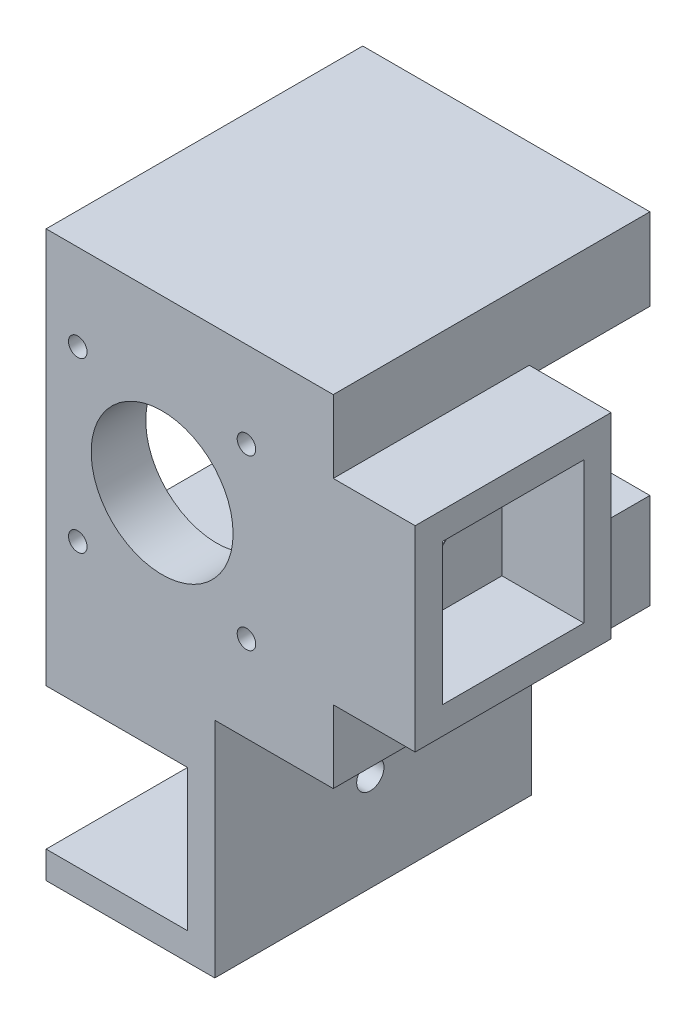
ISO-10303-21;
HEADER;
FILE_DESCRIPTION(('STEP AP214'),'2;1');
FILE_NAME('part.step','',(''),(''),'','','');
FILE_SCHEMA(('AUTOMOTIVE_DESIGN { 1 0 10303 214 1 1 1 1 }'));
ENDSEC;
DATA;
#1=APPLICATION_CONTEXT('core data for automotive mechanical design processes');
#2=APPLICATION_PROTOCOL_DEFINITION('international standard','automotive_design',2000,#1);
#3=PRODUCT_CONTEXT('',#1,'mechanical');
#4=PRODUCT('Part','Part','',(#3));
#5=PRODUCT_RELATED_PRODUCT_CATEGORY('part','',(#4));
#6=PRODUCT_DEFINITION_FORMATION('','',#4);
#7=PRODUCT_DEFINITION_CONTEXT('part definition',#1,'design');
#8=PRODUCT_DEFINITION('design','',#6,#7);
#9=PRODUCT_DEFINITION_SHAPE('','',#8);
#10=(LENGTH_UNIT() NAMED_UNIT(*) SI_UNIT(.MILLI.,.METRE.));
#11=(NAMED_UNIT(*) PLANE_ANGLE_UNIT() SI_UNIT($,.RADIAN.));
#12=(NAMED_UNIT(*) SI_UNIT($,.STERADIAN.) SOLID_ANGLE_UNIT());
#13=UNCERTAINTY_MEASURE_WITH_UNIT(LENGTH_MEASURE(1.E-05),#10,'distance_accuracy_value','');
#14=(GEOMETRIC_REPRESENTATION_CONTEXT(3) GLOBAL_UNCERTAINTY_ASSIGNED_CONTEXT((#13)) GLOBAL_UNIT_ASSIGNED_CONTEXT((#10,
#11,#12)) REPRESENTATION_CONTEXT('',''));
#15=CARTESIAN_POINT('',(0.,0.,0.));
#16=DIRECTION('',(0.,0.,1.));
#17=DIRECTION('',(1.,0.,0.));
#18=AXIS2_PLACEMENT_3D('',#15,#16,#17);
#19=CARTESIAN_POINT('',(-21.25,-72.15,-48.));
#20=DIRECTION('',(1.,0.,0.));
#21=DIRECTION('',(0.,0.,-1.));
#22=AXIS2_PLACEMENT_3D('',#19,#20,#21);
#23=PLANE('',#22);
#24=DIRECTION('',(0.,1.,0.));
#25=VECTOR('',#24,1.);
#26=CARTESIAN_POINT('',(-21.25,-72.15,-48.));
#27=LINE('',#26,#25);
#28=CARTESIAN_POINT('',(-21.25,-41.25,-48.));
#29=VERTEX_POINT('',#28);
#30=CARTESIAN_POINT('',(-21.25,-21.25,-48.));
#31=VERTEX_POINT('',#30);
#32=EDGE_CURVE('E305',#29,#31,#27,.T.);
#33=ORIENTED_EDGE('',*,*,#32,.F.);
#34=DIRECTION('',(0.,0.,1.));
#35=VECTOR('',#34,1.);
#36=CARTESIAN_POINT('',(-21.25,-41.25,-48.));
#37=LINE('',#36,#35);
#38=CARTESIAN_POINT('',(-21.25,-41.25,10.));
#39=VERTEX_POINT('',#38);
#40=EDGE_CURVE('E279',#29,#39,#37,.T.);
#41=ORIENTED_EDGE('',*,*,#40,.T.);
#42=DIRECTION('',(0.,1.,0.));
#43=VECTOR('',#42,1.);
#44=CARTESIAN_POINT('',(-21.25,-72.15,10.));
#45=LINE('',#44,#43);
#46=CARTESIAN_POINT('',(-21.25,31.25,10.));
#47=VERTEX_POINT('',#46);
#48=EDGE_CURVE('E219',#39,#47,#45,.T.);
#49=ORIENTED_EDGE('',*,*,#48,.T.);
#50=DIRECTION('',(0.,0.,1.));
#51=VECTOR('',#50,1.);
#52=CARTESIAN_POINT('',(-21.25,31.25,-48.));
#53=LINE('',#52,#51);
#54=CARTESIAN_POINT('',(-21.25,31.25,-48.));
#55=VERTEX_POINT('',#54);
#56=EDGE_CURVE('E212',#55,#47,#53,.T.);
#57=ORIENTED_EDGE('',*,*,#56,.F.);
#58=DIRECTION('',(0.,1.,0.));
#59=VECTOR('',#58,1.);
#60=CARTESIAN_POINT('',(-21.25,31.25,-48.));
#61=LINE('',#60,#59);
#62=CARTESIAN_POINT('',(-21.25,21.25,-48.));
#63=VERTEX_POINT('',#62);
#64=EDGE_CURVE('E215',#63,#55,#61,.T.);
#65=ORIENTED_EDGE('',*,*,#64,.F.);
#66=DIRECTION('',(0.,0.,1.));
#67=VECTOR('',#66,1.);
#68=CARTESIAN_POINT('',(-21.25,21.25,-48.));
#69=LINE('',#68,#67);
#70=CARTESIAN_POINT('',(-21.25,21.25,0.));
#71=VERTEX_POINT('',#70);
#72=EDGE_CURVE('E459',#63,#71,#69,.T.);
#73=ORIENTED_EDGE('',*,*,#72,.T.);
#74=DIRECTION('',(0.,-1.,0.));
#75=VECTOR('',#74,1.);
#76=CARTESIAN_POINT('',(-21.25,-21.25,0.));
#77=LINE('',#76,#75);
#78=CARTESIAN_POINT('',(-21.25,-21.25,0.));
#79=VERTEX_POINT('',#78);
#80=EDGE_CURVE('E453',#71,#79,#77,.T.);
#81=ORIENTED_EDGE('',*,*,#80,.T.);
#82=DIRECTION('',(0.,0.,1.));
#83=VECTOR('',#82,1.);
#84=CARTESIAN_POINT('',(-21.25,-21.25,-48.));
#85=LINE('',#84,#83);
#86=EDGE_CURVE('E242',#31,#79,#85,.T.);
#87=ORIENTED_EDGE('',*,*,#86,.F.);
#88=EDGE_LOOP('',(#33,#41,#49,#57,#65,#73,#81,#87));
#89=FACE_BOUND('',#88,.T.);
#90=ADVANCED_FACE('F39',(#89),#23,.F.);
#91=CARTESIAN_POINT('',(31.35,0.,0.));
#92=DIRECTION('',(-1.,0.,0.));
#93=DIRECTION('',(0.,0.,1.));
#94=AXIS2_PLACEMENT_3D('',#91,#92,#93);
#95=PLANE('',#94);
#96=DIRECTION('',(0.,1.,0.));
#97=VECTOR('',#96,1.);
#98=CARTESIAN_POINT('',(31.35,-17.95,-25.9));
#99=LINE('',#98,#97);
#100=CARTESIAN_POINT('',(31.35,16.25,-25.9));
#101=VERTEX_POINT('',#100);
#102=CARTESIAN_POINT('',(31.35,17.95,-25.9));
#103=VERTEX_POINT('',#102);
#104=EDGE_CURVE('E399',#101,#103,#99,.T.);
#105=ORIENTED_EDGE('',*,*,#104,.F.);
#106=DIRECTION('',(0.,0.,1.));
#107=VECTOR('',#106,1.);
#108=CARTESIAN_POINT('',(31.35,16.25,-25.9));
#109=LINE('',#108,#107);
#110=CARTESIAN_POINT('',(31.35,16.25,-48.));
#111=VERTEX_POINT('',#110);
#112=EDGE_CURVE('E327',#111,#101,#109,.T.);
#113=ORIENTED_EDGE('',*,*,#112,.F.);
#114=DIRECTION('',(0.,1.,0.));
#115=VECTOR('',#114,1.);
#116=CARTESIAN_POINT('',(31.35,-31.25,-48.));
#117=LINE('',#116,#115);
#118=CARTESIAN_POINT('',(31.35,31.25,-48.));
#119=VERTEX_POINT('',#118);
#120=EDGE_CURVE('E417',#111,#119,#117,.T.);
#121=ORIENTED_EDGE('',*,*,#120,.T.);
#122=DIRECTION('',(0.,0.,1.));
#123=VECTOR('',#122,1.);
#124=CARTESIAN_POINT('',(31.35,31.25,9.99999999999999));
#125=LINE('',#124,#123);
#126=CARTESIAN_POINT('',(31.35,31.25,9.99999999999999));
#127=VERTEX_POINT('',#126);
#128=EDGE_CURVE('E237',#119,#127,#125,.T.);
#129=ORIENTED_EDGE('',*,*,#128,.T.);
#130=DIRECTION('',(0.,-1.,0.));
#131=VECTOR('',#130,1.);
#132=CARTESIAN_POINT('',(31.35,-31.25,9.99999999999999));
#133=LINE('',#132,#131);
#134=CARTESIAN_POINT('',(31.35,17.95,9.99999999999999));
#135=VERTEX_POINT('',#134);
#136=EDGE_CURVE('E423',#127,#135,#133,.T.);
#137=ORIENTED_EDGE('',*,*,#136,.T.);
#138=DIRECTION('',(0.,0.,1.));
#139=VECTOR('',#138,1.);
#140=CARTESIAN_POINT('',(31.35,17.95,9.99999999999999));
#141=LINE('',#140,#139);
#142=EDGE_CURVE('E403',#103,#135,#141,.T.);
#143=ORIENTED_EDGE('',*,*,#142,.F.);
#144=EDGE_LOOP('',(#105,#113,#121,#129,#137,#143));
#145=FACE_BOUND('',#144,.T.);
#146=ADVANCED_FACE('F490',(#145),#95,.F.);
#147=CARTESIAN_POINT('',(0.,0.,-48.));
#148=DIRECTION('',(0.,0.,-1.));
#149=DIRECTION('',(-1.,0.,0.));
#150=AXIS2_PLACEMENT_3D('',#147,#148,#149);
#151=PLANE('',#150);
#152=ORIENTED_EDGE('',*,*,#64,.T.);
#153=DIRECTION('',(-1.,0.,0.));
#154=VECTOR('',#153,1.);
#155=CARTESIAN_POINT('',(-31.25,31.25,-48.));
#156=LINE('',#155,#154);
#157=EDGE_CURVE('E230',#119,#55,#156,.T.);
#158=ORIENTED_EDGE('',*,*,#157,.F.);
#159=ORIENTED_EDGE('',*,*,#120,.F.);
#160=DIRECTION('',(1.,0.,0.));
#161=VECTOR('',#160,1.);
#162=CARTESIAN_POINT('',(-31.25,16.25,-48.));
#163=LINE('',#162,#161);
#164=CARTESIAN_POINT('',(21.25,16.25,-48.));
#165=VERTEX_POINT('',#164);
#166=EDGE_CURVE('E334',#165,#111,#163,.T.);
#167=ORIENTED_EDGE('',*,*,#166,.F.);
#168=DIRECTION('',(0.,1.,0.));
#169=VECTOR('',#168,1.);
#170=CARTESIAN_POINT('',(21.25,-21.25,-48.));
#171=LINE('',#170,#169);
#172=CARTESIAN_POINT('',(21.25,21.25,-48.));
#173=VERTEX_POINT('',#172);
#174=EDGE_CURVE('E443',#165,#173,#171,.T.);
#175=ORIENTED_EDGE('',*,*,#174,.T.);
#176=DIRECTION('',(-1.,0.,0.));
#177=VECTOR('',#176,1.);
#178=CARTESIAN_POINT('',(-21.25,21.25,-48.));
#179=LINE('',#178,#177);
#180=EDGE_CURVE('E233',#173,#63,#179,.T.);
#181=ORIENTED_EDGE('',*,*,#180,.T.);
#182=EDGE_LOOP('',(#152,#158,#159,#167,#175,#181));
#183=FACE_BOUND('',#182,.T.);
#184=ADVANCED_FACE('F228',(#183),#151,.T.);
#185=CARTESIAN_POINT('',(21.35,0.,-7.95000000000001));
#186=DIRECTION('',(1.,0.,0.));
#187=DIRECTION('',(0.,0.,-1.));
#188=AXIS2_PLACEMENT_3D('',#185,#186,#187);
#189=CYLINDRICAL_SURFACE('',#188,3.43);
#190=CARTESIAN_POINT('',(31.35,0.,-7.95000000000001));
#191=DIRECTION('',(1.,0.,0.));
#192=DIRECTION('',(0.,0.,-1.));
#193=AXIS2_PLACEMENT_3D('',#190,#191,#192);
#194=CIRCLE('',#193,3.43);
#195=CARTESIAN_POINT('',(31.35,0.,-11.38));
#196=VERTEX_POINT('',#195);
#197=EDGE_CURVE('E250',#196,#196,#194,.T.);
#198=ORIENTED_EDGE('',*,*,#197,.T.);
#199=EDGE_LOOP('',(#198));
#200=FACE_BOUND('',#199,.T.);
#201=CARTESIAN_POINT('',(31.25,0.,-7.95000000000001));
#202=DIRECTION('',(-1.,0.,0.));
#203=DIRECTION('',(0.,0.,1.));
#204=AXIS2_PLACEMENT_3D('',#201,#202,#203);
#205=CIRCLE('',#204,3.43);
#206=CARTESIAN_POINT('',(31.25,0.,-4.52));
#207=VERTEX_POINT('',#206);
#208=EDGE_CURVE('E248',#207,#207,#205,.F.);
#209=ORIENTED_EDGE('',*,*,#208,.F.);
#210=EDGE_LOOP('',(#209));
#211=FACE_BOUND('',#210,.T.);
#212=ADVANCED_FACE('F592',(#200,#211),#189,.F.);
#213=CARTESIAN_POINT('',(31.35,-31.25,-48.));
#214=VERTEX_POINT('',#213);
#215=CARTESIAN_POINT('',(31.35,-13.75,-48.));
#216=VERTEX_POINT('',#215);
#217=EDGE_CURVE('E418',#214,#216,#117,.T.);
#218=ORIENTED_EDGE('',*,*,#217,.T.);
#219=DIRECTION('',(0.,0.,-1.));
#220=VECTOR('',#219,1.);
#221=CARTESIAN_POINT('',(31.35,-13.75,-25.9));
#222=LINE('',#221,#220);
#223=CARTESIAN_POINT('',(31.35,-13.75,-25.9));
#224=VERTEX_POINT('',#223);
#225=EDGE_CURVE('E325',#224,#216,#222,.T.);
#226=ORIENTED_EDGE('',*,*,#225,.F.);
#227=CARTESIAN_POINT('',(31.35,-17.95,-25.9));
#228=VERTEX_POINT('',#227);
#229=EDGE_CURVE('E400',#228,#224,#99,.T.);
#230=ORIENTED_EDGE('',*,*,#229,.F.);
#231=DIRECTION('',(0.,0.,-1.));
#232=VECTOR('',#231,1.);
#233=CARTESIAN_POINT('',(31.35,-17.95,9.99999999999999));
#234=LINE('',#233,#232);
#235=CARTESIAN_POINT('',(31.35,-17.95,9.99999999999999));
#236=VERTEX_POINT('',#235);
#237=EDGE_CURVE('E406',#236,#228,#234,.T.);
#238=ORIENTED_EDGE('',*,*,#237,.F.);
#239=CARTESIAN_POINT('',(31.35,-31.25,9.99999999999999));
#240=VERTEX_POINT('',#239);
#241=EDGE_CURVE('E422',#236,#240,#133,.T.);
#242=ORIENTED_EDGE('',*,*,#241,.T.);
#243=DIRECTION('',(0.,0.,-1.));
#244=VECTOR('',#243,1.);
#245=CARTESIAN_POINT('',(31.35,-31.25,9.99999999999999));
#246=LINE('',#245,#244);
#247=EDGE_CURVE('E426',#240,#214,#246,.T.);
#248=ORIENTED_EDGE('',*,*,#247,.T.);
#249=EDGE_LOOP('',(#218,#226,#230,#238,#242,#248));
#250=FACE_BOUND('',#249,.T.);
#251=ADVANCED_FACE('F507',(#250),#95,.F.);
#252=CARTESIAN_POINT('',(-31.25,-31.25,-48.));
#253=DIRECTION('',(0.,-1.,0.));
#254=DIRECTION('',(0.,0.,-1.));
#255=AXIS2_PLACEMENT_3D('',#252,#253,#254);
#256=PLANE('',#255);
#257=DIRECTION('',(0.,0.,1.));
#258=VECTOR('',#257,1.);
#259=CARTESIAN_POINT('',(9.64999999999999,-31.25,-48.));
#260=LINE('',#259,#258);
#261=CARTESIAN_POINT('',(9.64999999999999,-31.25,-48.));
#262=VERTEX_POINT('',#261);
#263=CARTESIAN_POINT('',(9.64999999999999,-31.25,10.));
#264=VERTEX_POINT('',#263);
#265=EDGE_CURVE('E64',#262,#264,#260,.T.);
#266=ORIENTED_EDGE('',*,*,#265,.F.);
#267=DIRECTION('',(1.,0.,0.));
#268=VECTOR('',#267,1.);
#269=CARTESIAN_POINT('',(-31.25,-31.25,-48.));
#270=LINE('',#269,#268);
#271=EDGE_CURVE('E48',#262,#214,#270,.T.);
#272=ORIENTED_EDGE('',*,*,#271,.T.);
#273=ORIENTED_EDGE('',*,*,#247,.F.);
#274=DIRECTION('',(1.,0.,0.));
#275=VECTOR('',#274,1.);
#276=CARTESIAN_POINT('',(-31.25,-31.25,10.));
#277=LINE('',#276,#275);
#278=EDGE_CURVE('E437',#264,#240,#277,.T.);
#279=ORIENTED_EDGE('',*,*,#278,.F.);
#280=EDGE_LOOP('',(#266,#272,#273,#279));
#281=FACE_BOUND('',#280,.T.);
#282=ADVANCED_FACE('F641',(#281),#256,.T.);
#283=CARTESIAN_POINT('',(-31.25,31.25,-48.));
#284=DIRECTION('',(0.,1.,0.));
#285=DIRECTION('',(0.,0.,1.));
#286=AXIS2_PLACEMENT_3D('',#283,#284,#285);
#287=PLANE('',#286);
#288=ORIENTED_EDGE('',*,*,#56,.T.);
#289=DIRECTION('',(-1.,0.,0.));
#290=VECTOR('',#289,1.);
#291=CARTESIAN_POINT('',(-31.25,31.25,10.));
#292=LINE('',#291,#290);
#293=EDGE_CURVE('E433',#127,#47,#292,.T.);
#294=ORIENTED_EDGE('',*,*,#293,.F.);
#295=ORIENTED_EDGE('',*,*,#128,.F.);
#296=ORIENTED_EDGE('',*,*,#157,.T.);
#297=EDGE_LOOP('',(#288,#294,#295,#296));
#298=FACE_BOUND('',#297,.T.);
#299=ADVANCED_FACE('F41',(#298),#287,.T.);
#300=ORIENTED_EDGE('',*,*,#32,.T.);
#301=DIRECTION('',(1.,0.,0.));
#302=VECTOR('',#301,1.);
#303=CARTESIAN_POINT('',(-21.25,-21.25,-48.));
#304=LINE('',#303,#302);
#305=CARTESIAN_POINT('',(21.25,-21.25,-48.));
#306=VERTEX_POINT('',#305);
#307=EDGE_CURVE('E445',#31,#306,#304,.T.);
#308=ORIENTED_EDGE('',*,*,#307,.T.);
#309=CARTESIAN_POINT('',(21.25,-13.75,-48.));
#310=VERTEX_POINT('',#309);
#311=EDGE_CURVE('E440',#306,#310,#171,.T.);
#312=ORIENTED_EDGE('',*,*,#311,.T.);
#313=DIRECTION('',(1.,0.,0.));
#314=VECTOR('',#313,1.);
#315=CARTESIAN_POINT('',(-31.25,-13.75,-48.));
#316=LINE('',#315,#314);
#317=EDGE_CURVE('E336',#310,#216,#316,.T.);
#318=ORIENTED_EDGE('',*,*,#317,.T.);
#319=ORIENTED_EDGE('',*,*,#217,.F.);
#320=ORIENTED_EDGE('',*,*,#271,.F.);
#321=DIRECTION('',(0.,1.,0.));
#322=VECTOR('',#321,1.);
#323=CARTESIAN_POINT('',(9.64999999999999,-72.15,-48.));
#324=LINE('',#323,#322);
#325=CARTESIAN_POINT('',(9.64999999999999,-72.15,-48.));
#326=VERTEX_POINT('',#325);
#327=EDGE_CURVE('E302',#326,#262,#324,.T.);
#328=ORIENTED_EDGE('',*,*,#327,.F.);
#329=DIRECTION('',(1.,0.,0.));
#330=VECTOR('',#329,1.);
#331=CARTESIAN_POINT('',(-21.25,-72.15,-48.));
#332=LINE('',#331,#330);
#333=CARTESIAN_POINT('',(-21.25,-72.15,-48.));
#334=VERTEX_POINT('',#333);
#335=EDGE_CURVE('E289',#334,#326,#332,.T.);
#336=ORIENTED_EDGE('',*,*,#335,.F.);
#337=CARTESIAN_POINT('',(-21.25,-67.15,-48.));
#338=VERTEX_POINT('',#337);
#339=EDGE_CURVE('E306',#334,#338,#27,.T.);
#340=ORIENTED_EDGE('',*,*,#339,.T.);
#341=DIRECTION('',(1.,0.,0.));
#342=VECTOR('',#341,1.);
#343=CARTESIAN_POINT('',(-21.25,-67.15,-48.));
#344=LINE('',#343,#342);
#345=CARTESIAN_POINT('',(4.65,-67.15,-48.));
#346=VERTEX_POINT('',#345);
#347=EDGE_CURVE('E56',#338,#346,#344,.T.);
#348=ORIENTED_EDGE('',*,*,#347,.T.);
#349=DIRECTION('',(0.,1.,0.));
#350=VECTOR('',#349,1.);
#351=CARTESIAN_POINT('',(4.64999999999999,-41.25,-48.));
#352=LINE('',#351,#350);
#353=CARTESIAN_POINT('',(4.64999999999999,-41.25,-48.));
#354=VERTEX_POINT('',#353);
#355=EDGE_CURVE('E265',#346,#354,#352,.T.);
#356=ORIENTED_EDGE('',*,*,#355,.T.);
#357=DIRECTION('',(-1.,0.,0.));
#358=VECTOR('',#357,1.);
#359=CARTESIAN_POINT('',(-21.25,-41.25,-48.));
#360=LINE('',#359,#358);
#361=EDGE_CURVE('E269',#354,#29,#360,.T.);
#362=ORIENTED_EDGE('',*,*,#361,.T.);
#363=EDGE_LOOP('',(#300,#308,#312,#318,#319,#320,#328,#336,#340,#348,#356,#362));
#364=FACE_BOUND('',#363,.T.);
#365=ADVANCED_FACE('F477',(#364),#151,.T.);
#366=CARTESIAN_POINT('',(21.25,-21.25,-48.));
#367=DIRECTION('',(1.,0.,0.));
#368=DIRECTION('',(0.,0.,-1.));
#369=AXIS2_PLACEMENT_3D('',#366,#367,#368);
#370=PLANE('',#369);
#371=CARTESIAN_POINT('',(21.25,0.,-7.95000000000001));
#372=DIRECTION('',(-1.,0.,0.));
#373=DIRECTION('',(0.,0.,1.));
#374=AXIS2_PLACEMENT_3D('',#371,#372,#373);
#375=CIRCLE('',#374,7.);
#376=CARTESIAN_POINT('',(21.25,0.,-0.950000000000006));
#377=VERTEX_POINT('',#376);
#378=EDGE_CURVE('E370',#377,#377,#375,.T.);
#379=ORIENTED_EDGE('',*,*,#378,.F.);
#380=EDGE_LOOP('',(#379));
#381=FACE_BOUND('',#380,.T.);
#382=ORIENTED_EDGE('',*,*,#174,.F.);
#383=DIRECTION('',(0.,0.,1.));
#384=VECTOR('',#383,1.);
#385=CARTESIAN_POINT('',(21.25,16.25,-48.));
#386=LINE('',#385,#384);
#387=CARTESIAN_POINT('',(21.25,16.25,-25.9));
#388=VERTEX_POINT('',#387);
#389=EDGE_CURVE('E342',#165,#388,#386,.T.);
#390=ORIENTED_EDGE('',*,*,#389,.T.);
#391=DIRECTION('',(0.,-1.,0.));
#392=VECTOR('',#391,1.);
#393=CARTESIAN_POINT('',(21.25,-21.25,-25.9));
#394=LINE('',#393,#392);
#395=CARTESIAN_POINT('',(21.25,-13.75,-25.9));
#396=VERTEX_POINT('',#395);
#397=EDGE_CURVE('E345',#388,#396,#394,.T.);
#398=ORIENTED_EDGE('',*,*,#397,.T.);
#399=DIRECTION('',(0.,0.,-1.));
#400=VECTOR('',#399,1.);
#401=CARTESIAN_POINT('',(21.25,-13.75,-48.));
#402=LINE('',#401,#400);
#403=EDGE_CURVE('E333',#396,#310,#402,.T.);
#404=ORIENTED_EDGE('',*,*,#403,.T.);
#405=ORIENTED_EDGE('',*,*,#311,.F.);
#406=DIRECTION('',(0.,0.,1.));
#407=VECTOR('',#406,1.);
#408=CARTESIAN_POINT('',(21.25,-21.25,-48.));
#409=LINE('',#408,#407);
#410=CARTESIAN_POINT('',(21.25,-21.25,0.));
#411=VERTEX_POINT('',#410);
#412=EDGE_CURVE('E238',#306,#411,#409,.T.);
#413=ORIENTED_EDGE('',*,*,#412,.T.);
#414=DIRECTION('',(0.,1.,0.));
#415=VECTOR('',#414,1.);
#416=CARTESIAN_POINT('',(21.25,-21.25,0.));
#417=LINE('',#416,#415);
#418=CARTESIAN_POINT('',(21.25,21.25,0.));
#419=VERTEX_POINT('',#418);
#420=EDGE_CURVE('E439',#411,#419,#417,.T.);
#421=ORIENTED_EDGE('',*,*,#420,.T.);
#422=DIRECTION('',(0.,0.,1.));
#423=VECTOR('',#422,1.);
#424=CARTESIAN_POINT('',(21.25,21.25,-48.));
#425=LINE('',#424,#423);
#426=EDGE_CURVE('E245',#173,#419,#425,.T.);
#427=ORIENTED_EDGE('',*,*,#426,.F.);
#428=EDGE_LOOP('',(#382,#390,#398,#404,#405,#413,#421,#427));
#429=FACE_BOUND('',#428,.T.);
#430=ADVANCED_FACE('F467',(#381,#429),#370,.F.);
#431=CARTESIAN_POINT('',(-21.25,-21.25,-48.));
#432=DIRECTION('',(0.,-1.,0.));
#433=DIRECTION('',(0.,0.,-1.));
#434=AXIS2_PLACEMENT_3D('',#431,#432,#433);
#435=PLANE('',#434);
#436=DIRECTION('',(1.,0.,0.));
#437=VECTOR('',#436,1.);
#438=CARTESIAN_POINT('',(-21.25,-21.25,0.));
#439=LINE('',#438,#437);
#440=EDGE_CURVE('E455',#79,#411,#439,.T.);
#441=ORIENTED_EDGE('',*,*,#440,.T.);
#442=ORIENTED_EDGE('',*,*,#412,.F.);
#443=ORIENTED_EDGE('',*,*,#307,.F.);
#444=ORIENTED_EDGE('',*,*,#86,.T.);
#445=EDGE_LOOP('',(#441,#442,#443,#444));
#446=FACE_BOUND('',#445,.T.);
#447=ADVANCED_FACE('F475',(#446),#435,.F.);
#448=CARTESIAN_POINT('',(-21.25,21.25,-48.));
#449=DIRECTION('',(0.,1.,0.));
#450=DIRECTION('',(0.,0.,1.));
#451=AXIS2_PLACEMENT_3D('',#448,#449,#450);
#452=PLANE('',#451);
#453=DIRECTION('',(-1.,0.,0.));
#454=VECTOR('',#453,1.);
#455=CARTESIAN_POINT('',(-21.25,21.25,0.));
#456=LINE('',#455,#454);
#457=EDGE_CURVE('E450',#419,#71,#456,.T.);
#458=ORIENTED_EDGE('',*,*,#457,.T.);
#459=ORIENTED_EDGE('',*,*,#72,.F.);
#460=ORIENTED_EDGE('',*,*,#180,.F.);
#461=ORIENTED_EDGE('',*,*,#426,.T.);
#462=EDGE_LOOP('',(#458,#459,#460,#461));
#463=FACE_BOUND('',#462,.T.);
#464=ADVANCED_FACE('F464',(#463),#452,.F.);
#465=CARTESIAN_POINT('',(0.,0.,0.));
#466=DIRECTION('',(0.,0.,-1.));
#467=DIRECTION('',(-1.,0.,0.));
#468=AXIS2_PLACEMENT_3D('',#465,#466,#467);
#469=PLANE('',#468);
#470=CARTESIAN_POINT('',(-15.45,-15.45,0.));
#471=DIRECTION('',(0.,0.,1.));
#472=DIRECTION('',(1.,0.,0.));
#473=AXIS2_PLACEMENT_3D('',#470,#471,#472);
#474=CIRCLE('',#473,1.7);
#475=CARTESIAN_POINT('',(-13.75,-15.45,0.));
#476=VERTEX_POINT('',#475);
#477=EDGE_CURVE('E348',#476,#476,#474,.T.);
#478=ORIENTED_EDGE('',*,*,#477,.T.);
#479=EDGE_LOOP('',(#478));
#480=FACE_BOUND('',#479,.T.);
#481=CARTESIAN_POINT('',(15.45,-15.45,0.));
#482=DIRECTION('',(0.,0.,1.));
#483=DIRECTION('',(1.,0.,0.));
#484=AXIS2_PLACEMENT_3D('',#481,#482,#483);
#485=CIRCLE('',#484,1.7);
#486=CARTESIAN_POINT('',(17.15,-15.45,0.));
#487=VERTEX_POINT('',#486);
#488=EDGE_CURVE('E359',#487,#487,#485,.T.);
#489=ORIENTED_EDGE('',*,*,#488,.T.);
#490=EDGE_LOOP('',(#489));
#491=FACE_BOUND('',#490,.T.);
#492=CARTESIAN_POINT('',(15.45,15.45,0.));
#493=DIRECTION('',(0.,0.,1.));
#494=DIRECTION('',(1.,0.,0.));
#495=AXIS2_PLACEMENT_3D('',#492,#493,#494);
#496=CIRCLE('',#495,1.7);
#497=CARTESIAN_POINT('',(17.15,15.45,0.));
#498=VERTEX_POINT('',#497);
#499=EDGE_CURVE('E353',#498,#498,#496,.T.);
#500=ORIENTED_EDGE('',*,*,#499,.T.);
#501=EDGE_LOOP('',(#500));
#502=FACE_BOUND('',#501,.T.);
#503=CARTESIAN_POINT('',(-15.45,15.45,0.));
#504=DIRECTION('',(0.,0.,1.));
#505=DIRECTION('',(1.,0.,0.));
#506=AXIS2_PLACEMENT_3D('',#503,#504,#505);
#507=CIRCLE('',#506,1.7);
#508=CARTESIAN_POINT('',(-13.75,15.45,0.));
#509=VERTEX_POINT('',#508);
#510=EDGE_CURVE('E367',#509,#509,#507,.T.);
#511=ORIENTED_EDGE('',*,*,#510,.T.);
#512=EDGE_LOOP('',(#511));
#513=FACE_BOUND('',#512,.T.);
#514=CARTESIAN_POINT('',(0.,0.,0.));
#515=DIRECTION('',(0.,0.,1.));
#516=DIRECTION('',(1.,0.,0.));
#517=AXIS2_PLACEMENT_3D('',#514,#515,#516);
#518=CIRCLE('',#517,13.);
#519=CARTESIAN_POINT('',(13.,0.,0.));
#520=VERTEX_POINT('',#519);
#521=EDGE_CURVE('E429',#520,#520,#518,.T.);
#522=ORIENTED_EDGE('',*,*,#521,.T.);
#523=EDGE_LOOP('',(#522));
#524=FACE_BOUND('',#523,.T.);
#525=ORIENTED_EDGE('',*,*,#457,.F.);
#526=ORIENTED_EDGE('',*,*,#420,.F.);
#527=ORIENTED_EDGE('',*,*,#440,.F.);
#528=ORIENTED_EDGE('',*,*,#80,.F.);
#529=EDGE_LOOP('',(#525,#526,#527,#528));
#530=FACE_BOUND('',#529,.T.);
#531=ADVANCED_FACE('F471',(#480,#491,#502,#513,#524,#530),#469,.T.);
#532=CARTESIAN_POINT('',(0.,0.,10.));
#533=DIRECTION('',(0.,0.,-1.));
#534=DIRECTION('',(-1.,0.,0.));
#535=AXIS2_PLACEMENT_3D('',#532,#533,#534);
#536=PLANE('',#535);
#537=CARTESIAN_POINT('',(-15.45,-15.45,10.));
#538=DIRECTION('',(0.,0.,1.));
#539=DIRECTION('',(1.,0.,0.));
#540=AXIS2_PLACEMENT_3D('',#537,#538,#539);
#541=CIRCLE('',#540,1.7);
#542=CARTESIAN_POINT('',(-13.75,-15.45,10.));
#543=VERTEX_POINT('',#542);
#544=EDGE_CURVE('E362',#543,#543,#541,.T.);
#545=ORIENTED_EDGE('',*,*,#544,.F.);
#546=EDGE_LOOP('',(#545));
#547=FACE_BOUND('',#546,.T.);
#548=CARTESIAN_POINT('',(15.45,-15.45,10.));
#549=DIRECTION('',(0.,0.,1.));
#550=DIRECTION('',(1.,0.,0.));
#551=AXIS2_PLACEMENT_3D('',#548,#549,#550);
#552=CIRCLE('',#551,1.7);
#553=CARTESIAN_POINT('',(17.15,-15.45,10.));
#554=VERTEX_POINT('',#553);
#555=EDGE_CURVE('E356',#554,#554,#552,.T.);
#556=ORIENTED_EDGE('',*,*,#555,.F.);
#557=EDGE_LOOP('',(#556));
#558=FACE_BOUND('',#557,.T.);
#559=CARTESIAN_POINT('',(15.45,15.45,10.));
#560=DIRECTION('',(0.,0.,1.));
#561=DIRECTION('',(1.,0.,0.));
#562=AXIS2_PLACEMENT_3D('',#559,#560,#561);
#563=CIRCLE('',#562,1.7);
#564=CARTESIAN_POINT('',(17.15,15.45,10.));
#565=VERTEX_POINT('',#564);
#566=EDGE_CURVE('E349',#565,#565,#563,.T.);
#567=ORIENTED_EDGE('',*,*,#566,.F.);
#568=EDGE_LOOP('',(#567));
#569=FACE_BOUND('',#568,.T.);
#570=CARTESIAN_POINT('',(-15.45,15.45,10.));
#571=DIRECTION('',(0.,0.,1.));
#572=DIRECTION('',(1.,0.,0.));
#573=AXIS2_PLACEMENT_3D('',#570,#571,#572);
#574=CIRCLE('',#573,1.7);
#575=CARTESIAN_POINT('',(-13.75,15.45,10.));
#576=VERTEX_POINT('',#575);
#577=EDGE_CURVE('E352',#576,#576,#574,.T.);
#578=ORIENTED_EDGE('',*,*,#577,.F.);
#579=EDGE_LOOP('',(#578));
#580=FACE_BOUND('',#579,.T.);
#581=ORIENTED_EDGE('',*,*,#293,.T.);
#582=ORIENTED_EDGE('',*,*,#48,.F.);
#583=DIRECTION('',(-1.,0.,0.));
#584=VECTOR('',#583,1.);
#585=CARTESIAN_POINT('',(-21.25,-41.25,10.));
#586=LINE('',#585,#584);
#587=CARTESIAN_POINT('',(4.64999999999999,-41.25,10.));
#588=VERTEX_POINT('',#587);
#589=EDGE_CURVE('E266',#588,#39,#586,.T.);
#590=ORIENTED_EDGE('',*,*,#589,.F.);
#591=DIRECTION('',(0.,1.,0.));
#592=VECTOR('',#591,1.);
#593=CARTESIAN_POINT('',(4.64999999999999,-41.25,10.));
#594=LINE('',#593,#592);
#595=CARTESIAN_POINT('',(4.65,-67.15,10.));
#596=VERTEX_POINT('',#595);
#597=EDGE_CURVE('E275',#596,#588,#594,.T.);
#598=ORIENTED_EDGE('',*,*,#597,.F.);
#599=DIRECTION('',(1.,0.,0.));
#600=VECTOR('',#599,1.);
#601=CARTESIAN_POINT('',(-21.25,-67.15,10.));
#602=LINE('',#601,#600);
#603=CARTESIAN_POINT('',(-21.25,-67.15,10.));
#604=VERTEX_POINT('',#603);
#605=EDGE_CURVE('E223',#604,#596,#602,.T.);
#606=ORIENTED_EDGE('',*,*,#605,.F.);
#607=CARTESIAN_POINT('',(-21.25,-72.15,10.));
#608=VERTEX_POINT('',#607);
#609=EDGE_CURVE('E296',#608,#604,#45,.T.);
#610=ORIENTED_EDGE('',*,*,#609,.F.);
#611=DIRECTION('',(-1.,0.,0.));
#612=VECTOR('',#611,1.);
#613=CARTESIAN_POINT('',(-21.25,-72.15,10.));
#614=LINE('',#613,#612);
#615=CARTESIAN_POINT('',(9.64999999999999,-72.15,10.));
#616=VERTEX_POINT('',#615);
#617=EDGE_CURVE('E293',#616,#608,#614,.T.);
#618=ORIENTED_EDGE('',*,*,#617,.F.);
#619=DIRECTION('',(0.,1.,0.));
#620=VECTOR('',#619,1.);
#621=CARTESIAN_POINT('',(9.64999999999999,-72.15,10.));
#622=LINE('',#621,#620);
#623=EDGE_CURVE('E299',#616,#264,#622,.T.);
#624=ORIENTED_EDGE('',*,*,#623,.T.);
#625=ORIENTED_EDGE('',*,*,#278,.T.);
#626=ORIENTED_EDGE('',*,*,#241,.F.);
#627=DIRECTION('',(-1.,0.,0.));
#628=VECTOR('',#627,1.);
#629=CARTESIAN_POINT('',(51.35,-17.95,9.99999999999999));
#630=LINE('',#629,#628);
#631=CARTESIAN_POINT('',(46.35,-17.95,9.99999999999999));
#632=VERTEX_POINT('',#631);
#633=EDGE_CURVE('E411',#632,#236,#630,.T.);
#634=ORIENTED_EDGE('',*,*,#633,.F.);
#635=DIRECTION('',(0.,1.,0.));
#636=VECTOR('',#635,1.);
#637=CARTESIAN_POINT('',(46.35,-31.25,9.99999999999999));
#638=LINE('',#637,#636);
#639=CARTESIAN_POINT('',(46.35,17.95,9.99999999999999));
#640=VERTEX_POINT('',#639);
#641=EDGE_CURVE('E312',#632,#640,#638,.T.);
#642=ORIENTED_EDGE('',*,*,#641,.T.);
#643=DIRECTION('',(-1.,0.,0.));
#644=VECTOR('',#643,1.);
#645=CARTESIAN_POINT('',(51.35,17.95,9.99999999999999));
#646=LINE('',#645,#644);
#647=EDGE_CURVE('E413',#640,#135,#646,.T.);
#648=ORIENTED_EDGE('',*,*,#647,.T.);
#649=ORIENTED_EDGE('',*,*,#136,.F.);
#650=EDGE_LOOP('',(#581,#582,#590,#598,#606,#610,#618,#624,#625,#626,#634,#642,#648,#649));
#651=FACE_BOUND('',#650,.T.);
#652=CARTESIAN_POINT('',(0.,0.,10.));
#653=DIRECTION('',(0.,0.,1.));
#654=DIRECTION('',(1.,0.,0.));
#655=AXIS2_PLACEMENT_3D('',#652,#653,#654);
#656=CIRCLE('',#655,13.);
#657=CARTESIAN_POINT('',(13.,0.,10.));
#658=VERTEX_POINT('',#657);
#659=EDGE_CURVE('E430',#658,#658,#656,.T.);
#660=ORIENTED_EDGE('',*,*,#659,.F.);
#661=EDGE_LOOP('',(#660));
#662=FACE_BOUND('',#661,.T.);
#663=ADVANCED_FACE('F484',(#547,#558,#569,#580,#651,#662),#536,.F.);
#664=CARTESIAN_POINT('',(0.,0.,10.));
#665=DIRECTION('',(0.,0.,-1.));
#666=DIRECTION('',(-1.,0.,0.));
#667=AXIS2_PLACEMENT_3D('',#664,#665,#666);
#668=CYLINDRICAL_SURFACE('',#667,13.);
#669=ORIENTED_EDGE('',*,*,#659,.T.);
#670=EDGE_LOOP('',(#669));
#671=FACE_BOUND('',#670,.T.);
#672=ORIENTED_EDGE('',*,*,#521,.F.);
#673=EDGE_LOOP('',(#672));
#674=FACE_BOUND('',#673,.T.);
#675=ADVANCED_FACE('F620',(#671,#674),#668,.F.);
#676=CARTESIAN_POINT('',(51.35,-17.95,-25.9));
#677=DIRECTION('',(0.,0.,1.));
#678=DIRECTION('',(1.,0.,0.));
#679=AXIS2_PLACEMENT_3D('',#676,#677,#678);
#680=PLANE('',#679);
#681=DIRECTION('',(-1.,0.,0.));
#682=VECTOR('',#681,1.);
#683=CARTESIAN_POINT('',(51.35,17.95,-25.9));
#684=LINE('',#683,#682);
#685=CARTESIAN_POINT('',(46.35,17.95,-25.9));
#686=VERTEX_POINT('',#685);
#687=EDGE_CURVE('E415',#686,#103,#684,.T.);
#688=ORIENTED_EDGE('',*,*,#687,.F.);
#689=DIRECTION('',(0.,1.,0.));
#690=VECTOR('',#689,1.);
#691=CARTESIAN_POINT('',(46.35,-31.25,-25.9));
#692=LINE('',#691,#690);
#693=CARTESIAN_POINT('',(46.35,-17.95,-25.9));
#694=VERTEX_POINT('',#693);
#695=EDGE_CURVE('E311',#694,#686,#692,.T.);
#696=ORIENTED_EDGE('',*,*,#695,.F.);
#697=DIRECTION('',(-1.,0.,0.));
#698=VECTOR('',#697,1.);
#699=CARTESIAN_POINT('',(51.35,-17.95,-25.9));
#700=LINE('',#699,#698);
#701=EDGE_CURVE('E409',#694,#228,#700,.T.);
#702=ORIENTED_EDGE('',*,*,#701,.T.);
#703=ORIENTED_EDGE('',*,*,#229,.T.);
#704=DIRECTION('',(1.,0.,0.));
#705=VECTOR('',#704,1.);
#706=CARTESIAN_POINT('',(-31.25,-13.75,-25.9));
#707=LINE('',#706,#705);
#708=EDGE_CURVE('E329',#396,#224,#707,.T.);
#709=ORIENTED_EDGE('',*,*,#708,.F.);
#710=ORIENTED_EDGE('',*,*,#397,.F.);
#711=DIRECTION('',(1.,0.,0.));
#712=VECTOR('',#711,1.);
#713=CARTESIAN_POINT('',(-31.25,16.25,-25.9));
#714=LINE('',#713,#712);
#715=EDGE_CURVE('E330',#388,#101,#714,.T.);
#716=ORIENTED_EDGE('',*,*,#715,.T.);
#717=ORIENTED_EDGE('',*,*,#104,.T.);
#718=EDGE_LOOP('',(#688,#696,#702,#703,#709,#710,#716,#717));
#719=FACE_BOUND('',#718,.T.);
#720=ADVANCED_FACE('F500',(#719),#680,.F.);
#721=CARTESIAN_POINT('',(51.35,17.95,9.99999999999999));
#722=DIRECTION('',(0.,-1.,0.));
#723=DIRECTION('',(0.,0.,-1.));
#724=AXIS2_PLACEMENT_3D('',#721,#722,#723);
#725=PLANE('',#724);
#726=ORIENTED_EDGE('',*,*,#647,.F.);
#727=DIRECTION('',(0.,0.,1.));
#728=VECTOR('',#727,1.);
#729=CARTESIAN_POINT('',(46.35,17.95,9.99999999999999));
#730=LINE('',#729,#728);
#731=EDGE_CURVE('E309',#686,#640,#730,.T.);
#732=ORIENTED_EDGE('',*,*,#731,.F.);
#733=ORIENTED_EDGE('',*,*,#687,.T.);
#734=ORIENTED_EDGE('',*,*,#142,.T.);
#735=EDGE_LOOP('',(#726,#732,#733,#734));
#736=FACE_BOUND('',#735,.T.);
#737=ADVANCED_FACE('F614',(#736),#725,.F.);
#738=CARTESIAN_POINT('',(51.35,-17.95,9.99999999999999));
#739=DIRECTION('',(0.,1.,0.));
#740=DIRECTION('',(0.,0.,1.));
#741=AXIS2_PLACEMENT_3D('',#738,#739,#740);
#742=PLANE('',#741);
#743=ORIENTED_EDGE('',*,*,#701,.F.);
#744=DIRECTION('',(0.,0.,1.));
#745=VECTOR('',#744,1.);
#746=CARTESIAN_POINT('',(46.35,-17.95,9.99999999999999));
#747=LINE('',#746,#745);
#748=EDGE_CURVE('E322',#694,#632,#747,.T.);
#749=ORIENTED_EDGE('',*,*,#748,.T.);
#750=ORIENTED_EDGE('',*,*,#633,.T.);
#751=ORIENTED_EDGE('',*,*,#237,.T.);
#752=EDGE_LOOP('',(#743,#749,#750,#751));
#753=FACE_BOUND('',#752,.T.);
#754=ADVANCED_FACE('F610',(#753),#742,.F.);
#755=CARTESIAN_POINT('',(51.35,-12.95,-20.9));
#756=DIRECTION('',(0.,0.,1.));
#757=DIRECTION('',(1.,0.,0.));
#758=AXIS2_PLACEMENT_3D('',#755,#756,#757);
#759=PLANE('',#758);
#760=DIRECTION('',(0.,-1.,0.));
#761=VECTOR('',#760,1.);
#762=CARTESIAN_POINT('',(46.35,-12.95,-20.9));
#763=LINE('',#762,#761);
#764=CARTESIAN_POINT('',(46.35,12.95,-20.9));
#765=VERTEX_POINT('',#764);
#766=CARTESIAN_POINT('',(46.35,-12.95,-20.9));
#767=VERTEX_POINT('',#766);
#768=EDGE_CURVE('E320',#765,#767,#763,.T.);
#769=ORIENTED_EDGE('',*,*,#768,.F.);
#770=DIRECTION('',(-1.,0.,0.));
#771=VECTOR('',#770,1.);
#772=CARTESIAN_POINT('',(51.35,12.95,-20.9));
#773=LINE('',#772,#771);
#774=CARTESIAN_POINT('',(31.35,12.95,-20.9));
#775=VERTEX_POINT('',#774);
#776=EDGE_CURVE('E397',#765,#775,#773,.T.);
#777=ORIENTED_EDGE('',*,*,#776,.T.);
#778=DIRECTION('',(0.,1.,0.));
#779=VECTOR('',#778,1.);
#780=CARTESIAN_POINT('',(31.35,-12.95,-20.9));
#781=LINE('',#780,#779);
#782=CARTESIAN_POINT('',(31.35,-12.95,-20.9));
#783=VERTEX_POINT('',#782);
#784=EDGE_CURVE('E379',#783,#775,#781,.T.);
#785=ORIENTED_EDGE('',*,*,#784,.F.);
#786=DIRECTION('',(-1.,0.,0.));
#787=VECTOR('',#786,1.);
#788=CARTESIAN_POINT('',(51.35,-12.95,-20.9));
#789=LINE('',#788,#787);
#790=EDGE_CURVE('E391',#767,#783,#789,.T.);
#791=ORIENTED_EDGE('',*,*,#790,.F.);
#792=EDGE_LOOP('',(#769,#777,#785,#791));
#793=FACE_BOUND('',#792,.T.);
#794=ADVANCED_FACE('F606',(#793),#759,.T.);
#795=CARTESIAN_POINT('',(51.35,12.95,5.));
#796=DIRECTION('',(0.,-1.,0.));
#797=DIRECTION('',(0.,0.,-1.));
#798=AXIS2_PLACEMENT_3D('',#795,#796,#797);
#799=PLANE('',#798);
#800=DIRECTION('',(0.,0.,-1.));
#801=VECTOR('',#800,1.);
#802=CARTESIAN_POINT('',(46.35,12.95,5.));
#803=LINE('',#802,#801);
#804=CARTESIAN_POINT('',(46.35,12.95,5.));
#805=VERTEX_POINT('',#804);
#806=EDGE_CURVE('E318',#805,#765,#803,.T.);
#807=ORIENTED_EDGE('',*,*,#806,.F.);
#808=DIRECTION('',(-1.,0.,0.));
#809=VECTOR('',#808,1.);
#810=CARTESIAN_POINT('',(51.35,12.95,5.));
#811=LINE('',#810,#809);
#812=CARTESIAN_POINT('',(31.35,12.95,5.));
#813=VERTEX_POINT('',#812);
#814=EDGE_CURVE('E395',#805,#813,#811,.T.);
#815=ORIENTED_EDGE('',*,*,#814,.T.);
#816=DIRECTION('',(0.,0.,1.));
#817=VECTOR('',#816,1.);
#818=CARTESIAN_POINT('',(31.35,12.95,5.));
#819=LINE('',#818,#817);
#820=EDGE_CURVE('E382',#775,#813,#819,.T.);
#821=ORIENTED_EDGE('',*,*,#820,.F.);
#822=ORIENTED_EDGE('',*,*,#776,.F.);
#823=EDGE_LOOP('',(#807,#815,#821,#822));
#824=FACE_BOUND('',#823,.T.);
#825=ADVANCED_FACE('F602',(#824),#799,.T.);
#826=CARTESIAN_POINT('',(51.35,-12.95,5.));
#827=DIRECTION('',(0.,0.,-1.));
#828=DIRECTION('',(-1.,0.,0.));
#829=AXIS2_PLACEMENT_3D('',#826,#827,#828);
#830=PLANE('',#829);
#831=DIRECTION('',(0.,1.,0.));
#832=VECTOR('',#831,1.);
#833=CARTESIAN_POINT('',(46.35,-12.95,5.));
#834=LINE('',#833,#832);
#835=CARTESIAN_POINT('',(46.35,-12.95,5.));
#836=VERTEX_POINT('',#835);
#837=EDGE_CURVE('E315',#836,#805,#834,.T.);
#838=ORIENTED_EDGE('',*,*,#837,.F.);
#839=DIRECTION('',(-1.,0.,0.));
#840=VECTOR('',#839,1.);
#841=CARTESIAN_POINT('',(51.35,-12.95,5.));
#842=LINE('',#841,#840);
#843=CARTESIAN_POINT('',(31.35,-12.95,5.));
#844=VERTEX_POINT('',#843);
#845=EDGE_CURVE('E393',#836,#844,#842,.T.);
#846=ORIENTED_EDGE('',*,*,#845,.T.);
#847=DIRECTION('',(0.,-1.,0.));
#848=VECTOR('',#847,1.);
#849=CARTESIAN_POINT('',(31.35,-12.95,5.));
#850=LINE('',#849,#848);
#851=EDGE_CURVE('E385',#813,#844,#850,.T.);
#852=ORIENTED_EDGE('',*,*,#851,.F.);
#853=ORIENTED_EDGE('',*,*,#814,.F.);
#854=EDGE_LOOP('',(#838,#846,#852,#853));
#855=FACE_BOUND('',#854,.T.);
#856=ADVANCED_FACE('F598',(#855),#830,.T.);
#857=CARTESIAN_POINT('',(51.35,-12.95,5.));
#858=DIRECTION('',(0.,1.,0.));
#859=DIRECTION('',(0.,0.,1.));
#860=AXIS2_PLACEMENT_3D('',#857,#858,#859);
#861=PLANE('',#860);
#862=DIRECTION('',(0.,0.,1.));
#863=VECTOR('',#862,1.);
#864=CARTESIAN_POINT('',(46.35,-12.95,5.));
#865=LINE('',#864,#863);
#866=EDGE_CURVE('E11',#767,#836,#865,.T.);
#867=ORIENTED_EDGE('',*,*,#866,.F.);
#868=ORIENTED_EDGE('',*,*,#790,.T.);
#869=DIRECTION('',(0.,0.,-1.));
#870=VECTOR('',#869,1.);
#871=CARTESIAN_POINT('',(31.35,-12.95,5.));
#872=LINE('',#871,#870);
#873=EDGE_CURVE('E388',#844,#783,#872,.T.);
#874=ORIENTED_EDGE('',*,*,#873,.F.);
#875=ORIENTED_EDGE('',*,*,#845,.F.);
#876=EDGE_LOOP('',(#867,#868,#874,#875));
#877=FACE_BOUND('',#876,.T.);
#878=ADVANCED_FACE('F596',(#877),#861,.T.);
#879=ORIENTED_EDGE('',*,*,#197,.F.);
#880=EDGE_LOOP('',(#879));
#881=FACE_BOUND('',#880,.T.);
#882=ORIENTED_EDGE('',*,*,#851,.T.);
#883=ORIENTED_EDGE('',*,*,#873,.T.);
#884=ORIENTED_EDGE('',*,*,#784,.T.);
#885=ORIENTED_EDGE('',*,*,#820,.T.);
#886=EDGE_LOOP('',(#882,#883,#884,#885));
#887=FACE_BOUND('',#886,.T.);
#888=ADVANCED_FACE('F548',(#881,#887),#95,.F.);
#889=CARTESIAN_POINT('',(31.25,0.,-7.95000000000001));
#890=DIRECTION('',(-1.,0.,0.));
#891=DIRECTION('',(0.,0.,1.));
#892=AXIS2_PLACEMENT_3D('',#889,#890,#891);
#893=PLANE('',#892);
#894=CARTESIAN_POINT('',(31.25,0.,-7.95000000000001));
#895=DIRECTION('',(-1.,0.,0.));
#896=DIRECTION('',(0.,0.,1.));
#897=AXIS2_PLACEMENT_3D('',#894,#895,#896);
#898=CIRCLE('',#897,7.);
#899=CARTESIAN_POINT('',(31.25,0.,-0.950000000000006));
#900=VERTEX_POINT('',#899);
#901=EDGE_CURVE('E251',#900,#900,#898,.T.);
#902=ORIENTED_EDGE('',*,*,#901,.T.);
#903=EDGE_LOOP('',(#902));
#904=FACE_BOUND('',#903,.T.);
#905=ORIENTED_EDGE('',*,*,#208,.T.);
#906=EDGE_LOOP('',(#905));
#907=FACE_BOUND('',#906,.T.);
#908=ADVANCED_FACE('F585',(#904,#907),#893,.T.);
#909=CARTESIAN_POINT('',(31.25,0.,-7.95000000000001));
#910=DIRECTION('',(-1.,0.,0.));
#911=DIRECTION('',(0.,0.,1.));
#912=AXIS2_PLACEMENT_3D('',#909,#910,#911);
#913=CYLINDRICAL_SURFACE('',#912,7.);
#914=ORIENTED_EDGE('',*,*,#901,.F.);
#915=EDGE_LOOP('',(#914));
#916=FACE_BOUND('',#915,.T.);
#917=ORIENTED_EDGE('',*,*,#378,.T.);
#918=EDGE_LOOP('',(#917));
#919=FACE_BOUND('',#918,.T.);
#920=ADVANCED_FACE('F583',(#916,#919),#913,.F.);
#921=CARTESIAN_POINT('',(-15.45,15.45,0.));
#922=DIRECTION('',(0.,0.,1.));
#923=DIRECTION('',(1.,0.,0.));
#924=AXIS2_PLACEMENT_3D('',#921,#922,#923);
#925=CYLINDRICAL_SURFACE('',#924,1.7);
#926=ORIENTED_EDGE('',*,*,#510,.F.);
#927=EDGE_LOOP('',(#926));
#928=FACE_BOUND('',#927,.T.);
#929=ORIENTED_EDGE('',*,*,#577,.T.);
#930=EDGE_LOOP('',(#929));
#931=FACE_BOUND('',#930,.T.);
#932=ADVANCED_FACE('F573',(#928,#931),#925,.F.);
#933=CARTESIAN_POINT('',(15.45,15.45,0.));
#934=DIRECTION('',(0.,0.,1.));
#935=DIRECTION('',(1.,0.,0.));
#936=AXIS2_PLACEMENT_3D('',#933,#934,#935);
#937=CYLINDRICAL_SURFACE('',#936,1.7);
#938=ORIENTED_EDGE('',*,*,#499,.F.);
#939=EDGE_LOOP('',(#938));
#940=FACE_BOUND('',#939,.T.);
#941=ORIENTED_EDGE('',*,*,#566,.T.);
#942=EDGE_LOOP('',(#941));
#943=FACE_BOUND('',#942,.T.);
#944=ADVANCED_FACE('F569',(#940,#943),#937,.F.);
#945=CARTESIAN_POINT('',(15.45,-15.45,0.));
#946=DIRECTION('',(0.,0.,1.));
#947=DIRECTION('',(1.,0.,0.));
#948=AXIS2_PLACEMENT_3D('',#945,#946,#947);
#949=CYLINDRICAL_SURFACE('',#948,1.7);
#950=ORIENTED_EDGE('',*,*,#488,.F.);
#951=EDGE_LOOP('',(#950));
#952=FACE_BOUND('',#951,.T.);
#953=ORIENTED_EDGE('',*,*,#555,.T.);
#954=EDGE_LOOP('',(#953));
#955=FACE_BOUND('',#954,.T.);
#956=ADVANCED_FACE('F572',(#952,#955),#949,.F.);
#957=CARTESIAN_POINT('',(-15.45,-15.45,0.));
#958=DIRECTION('',(0.,0.,1.));
#959=DIRECTION('',(1.,0.,0.));
#960=AXIS2_PLACEMENT_3D('',#957,#958,#959);
#961=CYLINDRICAL_SURFACE('',#960,1.7);
#962=ORIENTED_EDGE('',*,*,#477,.F.);
#963=EDGE_LOOP('',(#962));
#964=FACE_BOUND('',#963,.T.);
#965=ORIENTED_EDGE('',*,*,#544,.T.);
#966=EDGE_LOOP('',(#965));
#967=FACE_BOUND('',#966,.T.);
#968=ADVANCED_FACE('F568',(#964,#967),#961,.F.);
#969=CARTESIAN_POINT('',(-31.25,-13.75,-25.9));
#970=DIRECTION('',(0.,-1.,0.));
#971=DIRECTION('',(0.,0.,-1.));
#972=AXIS2_PLACEMENT_3D('',#969,#970,#971);
#973=PLANE('',#972);
#974=ORIENTED_EDGE('',*,*,#708,.T.);
#975=ORIENTED_EDGE('',*,*,#225,.T.);
#976=ORIENTED_EDGE('',*,*,#317,.F.);
#977=ORIENTED_EDGE('',*,*,#403,.F.);
#978=EDGE_LOOP('',(#974,#975,#976,#977));
#979=FACE_BOUND('',#978,.T.);
#980=ADVANCED_FACE('F505',(#979),#973,.F.);
#981=CARTESIAN_POINT('',(-31.25,16.25,-25.9));
#982=DIRECTION('',(0.,1.,0.));
#983=DIRECTION('',(0.,0.,1.));
#984=AXIS2_PLACEMENT_3D('',#981,#982,#983);
#985=PLANE('',#984);
#986=ORIENTED_EDGE('',*,*,#166,.T.);
#987=ORIENTED_EDGE('',*,*,#112,.T.);
#988=ORIENTED_EDGE('',*,*,#715,.F.);
#989=ORIENTED_EDGE('',*,*,#389,.F.);
#990=EDGE_LOOP('',(#986,#987,#988,#989));
#991=FACE_BOUND('',#990,.T.);
#992=ADVANCED_FACE('F495',(#991),#985,.F.);
#993=CARTESIAN_POINT('',(46.35,-31.25,9.99999999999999));
#994=DIRECTION('',(-1.,0.,0.));
#995=DIRECTION('',(0.,0.,1.));
#996=AXIS2_PLACEMENT_3D('',#993,#994,#995);
#997=PLANE('',#996);
#998=ORIENTED_EDGE('',*,*,#768,.T.);
#999=ORIENTED_EDGE('',*,*,#866,.T.);
#1000=ORIENTED_EDGE('',*,*,#837,.T.);
#1001=ORIENTED_EDGE('',*,*,#806,.T.);
#1002=EDGE_LOOP('',(#998,#999,#1000,#1001));
#1003=FACE_BOUND('',#1002,.T.);
#1004=ORIENTED_EDGE('',*,*,#695,.T.);
#1005=ORIENTED_EDGE('',*,*,#731,.T.);
#1006=ORIENTED_EDGE('',*,*,#641,.F.);
#1007=ORIENTED_EDGE('',*,*,#748,.F.);
#1008=EDGE_LOOP('',(#1004,#1005,#1006,#1007));
#1009=FACE_BOUND('',#1008,.T.);
#1010=ADVANCED_FACE('F552',(#1003,#1009),#997,.F.);
#1011=ORIENTED_EDGE('',*,*,#609,.T.);
#1012=DIRECTION('',(0.,0.,1.));
#1013=VECTOR('',#1012,1.);
#1014=CARTESIAN_POINT('',(-21.25,-67.15,-48.));
#1015=LINE('',#1014,#1013);
#1016=EDGE_CURVE('E272',#338,#604,#1015,.T.);
#1017=ORIENTED_EDGE('',*,*,#1016,.F.);
#1018=ORIENTED_EDGE('',*,*,#339,.F.);
#1019=DIRECTION('',(0.,0.,-1.));
#1020=VECTOR('',#1019,1.);
#1021=CARTESIAN_POINT('',(-21.25,-72.15,-48.));
#1022=LINE('',#1021,#1020);
#1023=EDGE_CURVE('E286',#608,#334,#1022,.T.);
#1024=ORIENTED_EDGE('',*,*,#1023,.F.);
#1025=EDGE_LOOP('',(#1011,#1017,#1018,#1024));
#1026=FACE_BOUND('',#1025,.T.);
#1027=ADVANCED_FACE('F524',(#1026),#23,.F.);
#1028=CARTESIAN_POINT('',(9.64999999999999,-72.15,-48.));
#1029=DIRECTION('',(-1.,0.,0.));
#1030=DIRECTION('',(0.,0.,1.));
#1031=AXIS2_PLACEMENT_3D('',#1028,#1029,#1030);
#1032=PLANE('',#1031);
#1033=CARTESIAN_POINT('',(9.64999999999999,-54.2,-18.4932281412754));
#1034=DIRECTION('',(1.,0.,0.));
#1035=DIRECTION('',(0.,0.,-1.));
#1036=AXIS2_PLACEMENT_3D('',#1033,#1034,#1035);
#1037=CIRCLE('',#1036,2.5);
#1038=CARTESIAN_POINT('',(9.64999999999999,-54.2,-20.9932281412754));
#1039=VERTEX_POINT('',#1038);
#1040=EDGE_CURVE('E253',#1039,#1039,#1037,.T.);
#1041=ORIENTED_EDGE('',*,*,#1040,.F.);
#1042=EDGE_LOOP('',(#1041));
#1043=FACE_BOUND('',#1042,.T.);
#1044=ORIENTED_EDGE('',*,*,#265,.T.);
#1045=ORIENTED_EDGE('',*,*,#623,.F.);
#1046=DIRECTION('',(0.,0.,1.));
#1047=VECTOR('',#1046,1.);
#1048=CARTESIAN_POINT('',(9.64999999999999,-72.15,-48.));
#1049=LINE('',#1048,#1047);
#1050=EDGE_CURVE('E291',#326,#616,#1049,.T.);
#1051=ORIENTED_EDGE('',*,*,#1050,.F.);
#1052=ORIENTED_EDGE('',*,*,#327,.T.);
#1053=EDGE_LOOP('',(#1044,#1045,#1051,#1052));
#1054=FACE_BOUND('',#1053,.T.);
#1055=ADVANCED_FACE('F515',(#1043,#1054),#1032,.F.);
#1056=CARTESIAN_POINT('',(0.,-72.15,0.));
#1057=DIRECTION('',(0.,1.,0.));
#1058=DIRECTION('',(0.,0.,1.));
#1059=AXIS2_PLACEMENT_3D('',#1056,#1057,#1058);
#1060=PLANE('',#1059);
#1061=CARTESIAN_POINT('',(-8.30000000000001,-72.15,-19.));
#1062=DIRECTION('',(0.,-1.,0.));
#1063=DIRECTION('',(0.,0.,-1.));
#1064=AXIS2_PLACEMENT_3D('',#1061,#1062,#1063);
#1065=CIRCLE('',#1064,2.5);
#1066=CARTESIAN_POINT('',(-8.30000000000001,-72.15,-21.5));
#1067=VERTEX_POINT('',#1066);
#1068=EDGE_CURVE('E261',#1067,#1067,#1065,.T.);
#1069=ORIENTED_EDGE('',*,*,#1068,.F.);
#1070=EDGE_LOOP('',(#1069));
#1071=FACE_BOUND('',#1070,.T.);
#1072=ORIENTED_EDGE('',*,*,#1023,.T.);
#1073=ORIENTED_EDGE('',*,*,#335,.T.);
#1074=ORIENTED_EDGE('',*,*,#1050,.T.);
#1075=ORIENTED_EDGE('',*,*,#617,.T.);
#1076=EDGE_LOOP('',(#1072,#1073,#1074,#1075));
#1077=FACE_BOUND('',#1076,.T.);
#1078=ADVANCED_FACE('F519',(#1071,#1077),#1060,.F.);
#1079=CARTESIAN_POINT('',(-21.25,-41.25,-48.));
#1080=DIRECTION('',(0.,1.,0.));
#1081=DIRECTION('',(-1.,0.,0.));
#1082=AXIS2_PLACEMENT_3D('',#1079,#1080,#1081);
#1083=PLANE('',#1082);
#1084=ORIENTED_EDGE('',*,*,#589,.T.);
#1085=ORIENTED_EDGE('',*,*,#40,.F.);
#1086=ORIENTED_EDGE('',*,*,#361,.F.);
#1087=DIRECTION('',(0.,0.,1.));
#1088=VECTOR('',#1087,1.);
#1089=CARTESIAN_POINT('',(4.64999999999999,-41.25,-48.));
#1090=LINE('',#1089,#1088);
#1091=EDGE_CURVE('E281',#354,#588,#1090,.T.);
#1092=ORIENTED_EDGE('',*,*,#1091,.T.);
#1093=EDGE_LOOP('',(#1084,#1085,#1086,#1092));
#1094=FACE_BOUND('',#1093,.T.);
#1095=ADVANCED_FACE('F481',(#1094),#1083,.F.);
#1096=CARTESIAN_POINT('',(4.64999999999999,-41.25,-48.));
#1097=DIRECTION('',(1.,0.,0.));
#1098=DIRECTION('',(0.,1.,0.));
#1099=AXIS2_PLACEMENT_3D('',#1096,#1097,#1098);
#1100=PLANE('',#1099);
#1101=CARTESIAN_POINT('',(4.64999999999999,-54.2,-18.4932281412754));
#1102=DIRECTION('',(1.,0.,0.));
#1103=DIRECTION('',(0.,1.,0.));
#1104=AXIS2_PLACEMENT_3D('',#1101,#1102,#1103);
#1105=CIRCLE('',#1104,2.5);
#1106=CARTESIAN_POINT('',(4.64999999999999,-51.7,-18.4932281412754));
#1107=VERTEX_POINT('',#1106);
#1108=EDGE_CURVE('E234',#1107,#1107,#1105,.T.);
#1109=ORIENTED_EDGE('',*,*,#1108,.T.);
#1110=EDGE_LOOP('',(#1109));
#1111=FACE_BOUND('',#1110,.T.);
#1112=ORIENTED_EDGE('',*,*,#597,.T.);
#1113=ORIENTED_EDGE('',*,*,#1091,.F.);
#1114=ORIENTED_EDGE('',*,*,#355,.F.);
#1115=DIRECTION('',(0.,0.,1.));
#1116=VECTOR('',#1115,1.);
#1117=CARTESIAN_POINT('',(4.65,-67.15,-48.));
#1118=LINE('',#1117,#1116);
#1119=EDGE_CURVE('E283',#346,#596,#1118,.T.);
#1120=ORIENTED_EDGE('',*,*,#1119,.T.);
#1121=EDGE_LOOP('',(#1112,#1113,#1114,#1120));
#1122=FACE_BOUND('',#1121,.T.);
#1123=ADVANCED_FACE('F528',(#1111,#1122),#1100,.F.);
#1124=CARTESIAN_POINT('',(-21.25,-67.15,-48.));
#1125=DIRECTION('',(0.,-1.,0.));
#1126=DIRECTION('',(0.,0.,-1.));
#1127=AXIS2_PLACEMENT_3D('',#1124,#1125,#1126);
#1128=PLANE('',#1127);
#1129=CARTESIAN_POINT('',(-8.30000000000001,-67.15,-19.));
#1130=DIRECTION('',(0.,-1.,0.));
#1131=DIRECTION('',(0.,0.,-1.));
#1132=AXIS2_PLACEMENT_3D('',#1129,#1130,#1131);
#1133=CIRCLE('',#1132,2.5);
#1134=CARTESIAN_POINT('',(-8.30000000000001,-67.15,-21.5));
#1135=VERTEX_POINT('',#1134);
#1136=EDGE_CURVE('E43',#1135,#1135,#1133,.T.);
#1137=ORIENTED_EDGE('',*,*,#1136,.T.);
#1138=EDGE_LOOP('',(#1137));
#1139=FACE_BOUND('',#1138,.T.);
#1140=ORIENTED_EDGE('',*,*,#605,.T.);
#1141=ORIENTED_EDGE('',*,*,#1119,.F.);
#1142=ORIENTED_EDGE('',*,*,#347,.F.);
#1143=ORIENTED_EDGE('',*,*,#1016,.T.);
#1144=EDGE_LOOP('',(#1140,#1141,#1142,#1143));
#1145=FACE_BOUND('',#1144,.T.);
#1146=ADVANCED_FACE('F526',(#1139,#1145),#1128,.F.);
#1147=CARTESIAN_POINT('',(-21.25,-54.2,-18.4932281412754));
#1148=DIRECTION('',(1.,0.,0.));
#1149=DIRECTION('',(0.,0.,-1.));
#1150=AXIS2_PLACEMENT_3D('',#1147,#1148,#1149);
#1151=CYLINDRICAL_SURFACE('',#1150,2.5);
#1152=ORIENTED_EDGE('',*,*,#1040,.T.);
#1153=EDGE_LOOP('',(#1152));
#1154=FACE_BOUND('',#1153,.T.);
#1155=ORIENTED_EDGE('',*,*,#1108,.F.);
#1156=EDGE_LOOP('',(#1155));
#1157=FACE_BOUND('',#1156,.T.);
#1158=ADVANCED_FACE('F536',(#1154,#1157),#1151,.F.);
#1159=CARTESIAN_POINT('',(-8.30000000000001,-51.25,-19.));
#1160=DIRECTION('',(0.,-1.,0.));
#1161=DIRECTION('',(0.,0.,-1.));
#1162=AXIS2_PLACEMENT_3D('',#1159,#1160,#1161);
#1163=CYLINDRICAL_SURFACE('',#1162,2.5);
#1164=ORIENTED_EDGE('',*,*,#1068,.T.);
#1165=EDGE_LOOP('',(#1164));
#1166=FACE_BOUND('',#1165,.T.);
#1167=ORIENTED_EDGE('',*,*,#1136,.F.);
#1168=EDGE_LOOP('',(#1167));
#1169=FACE_BOUND('',#1168,.T.);
#1170=ADVANCED_FACE('F814',(#1166,#1169),#1163,.F.);
#1171=CLOSED_SHELL('',(#90,#146,#184,#212,#251,#282,#299,#365,#430,#447,#464,#531,#663,#675,
#720,#737,#754,#794,#825,#856,#878,#888,#908,#920,#932,#944,#956,#968,#980,#992,#1010,#1027,
#1055,#1078,#1095,#1123,#1146,#1158,#1170));
#1172=MANIFOLD_SOLID_BREP('B2',#1171);
#1173=ADVANCED_BREP_SHAPE_REPRESENTATION('',(#18,#1172),#14);
#1174=SHAPE_DEFINITION_REPRESENTATION(#9,#1173);
ENDSEC;
END-ISO-10303-21;
